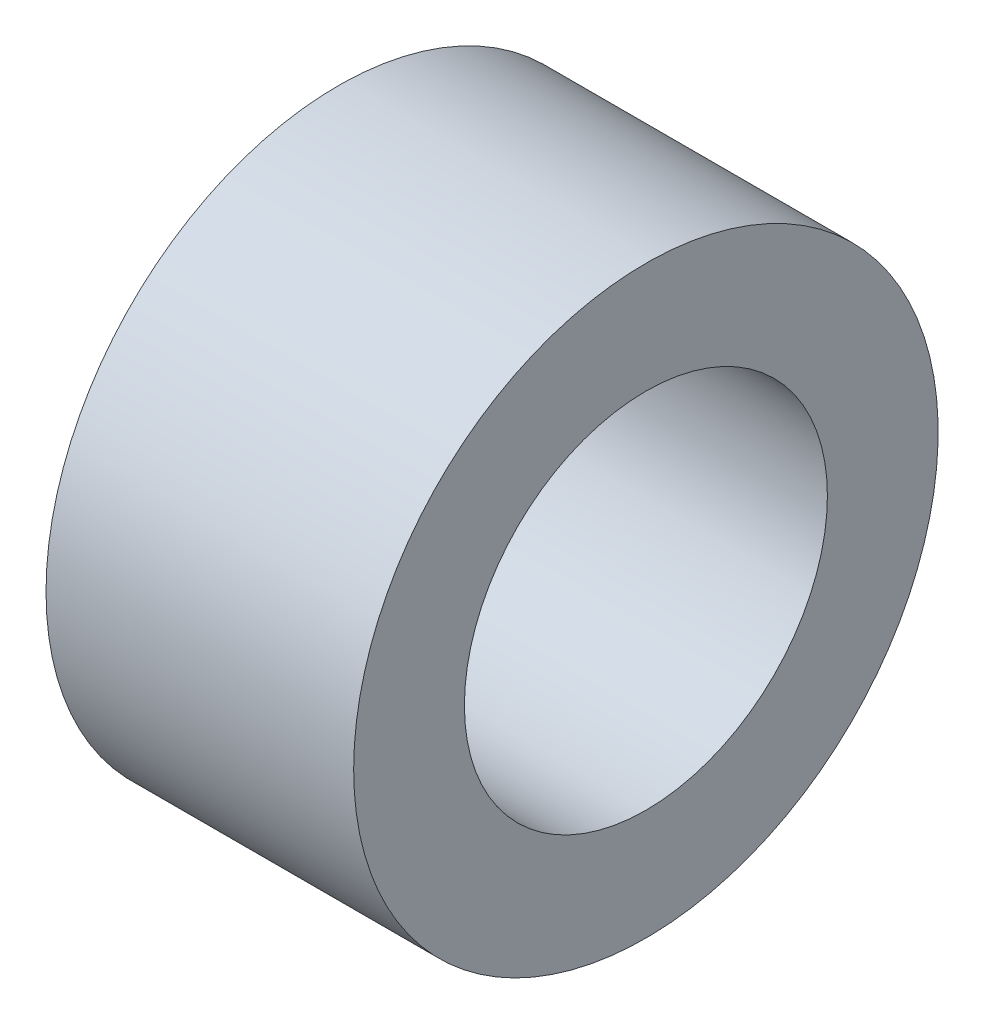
from build123d import *

# Parameters (mm, degrees)
ESQUISSE1_W = 10
ESQUISSE1_H = 3.6


with BuildPart() as part:
    # Esquisse1 → R_volution1 (revolve)
    with BuildSketch(Plane.XY, mode=Mode.PRIVATE) as r_volution1_sk:
        with Locations((5, 7.7)):
            Rectangle(ESQUISSE1_W, ESQUISSE1_H)
    revolve(r_volution1_sk.sketch.rotate(Axis((0, 0, 0), (1, 0, 0)), 90), axis=Axis((0, 0, 0), (1, 0, 0)))


solid = part.part
